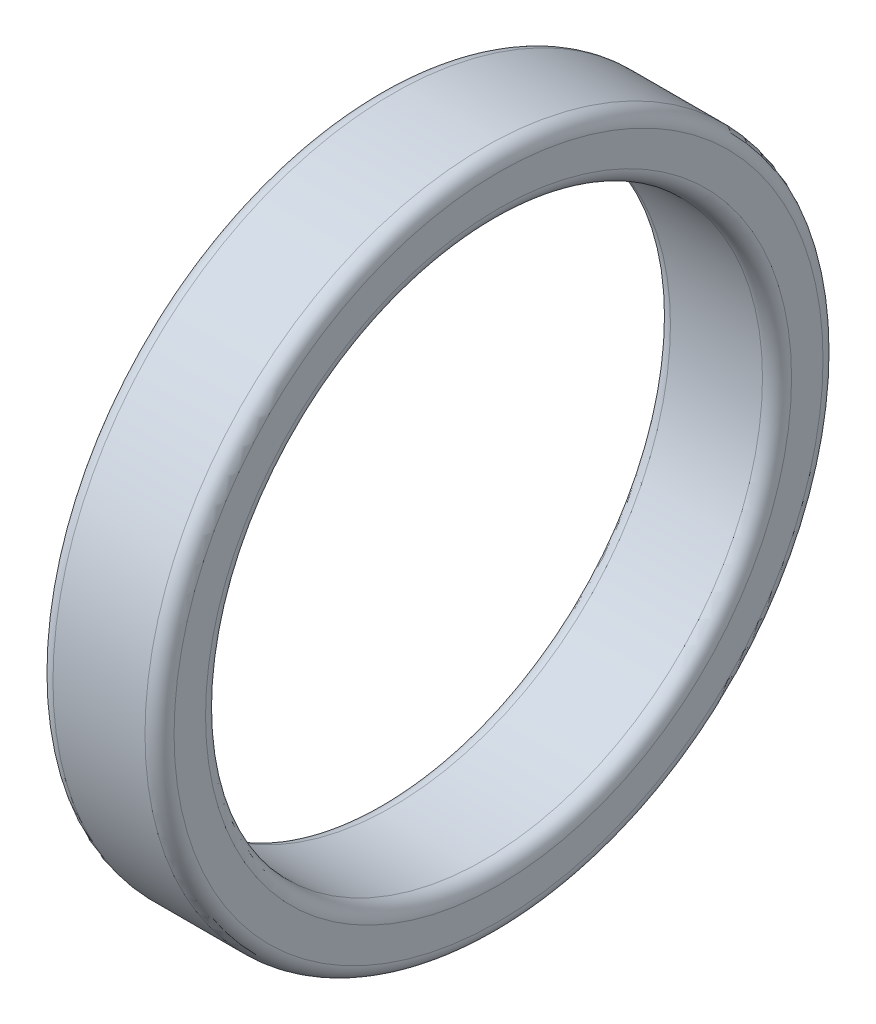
ISO-10303-21;
HEADER;
FILE_DESCRIPTION(('STEP AP214'),'2;1');
FILE_NAME('part.step','',(''),(''),'','','');
FILE_SCHEMA(('AUTOMOTIVE_DESIGN { 1 0 10303 214 1 1 1 1 }'));
ENDSEC;
DATA;
#1=APPLICATION_CONTEXT('core data for automotive mechanical design processes');
#2=APPLICATION_PROTOCOL_DEFINITION('international standard','automotive_design',2000,#1);
#3=PRODUCT_CONTEXT('',#1,'mechanical');
#4=PRODUCT('Part','Part','',(#3));
#5=PRODUCT_RELATED_PRODUCT_CATEGORY('part','',(#4));
#6=PRODUCT_DEFINITION_FORMATION('','',#4);
#7=PRODUCT_DEFINITION_CONTEXT('part definition',#1,'design');
#8=PRODUCT_DEFINITION('design','',#6,#7);
#9=PRODUCT_DEFINITION_SHAPE('','',#8);
#10=(LENGTH_UNIT() NAMED_UNIT(*) SI_UNIT(.MILLI.,.METRE.));
#11=(NAMED_UNIT(*) PLANE_ANGLE_UNIT() SI_UNIT($,.RADIAN.));
#12=(NAMED_UNIT(*) SI_UNIT($,.STERADIAN.) SOLID_ANGLE_UNIT());
#13=UNCERTAINTY_MEASURE_WITH_UNIT(LENGTH_MEASURE(1.E-05),#10,'distance_accuracy_value','');
#14=(GEOMETRIC_REPRESENTATION_CONTEXT(3) GLOBAL_UNCERTAINTY_ASSIGNED_CONTEXT((#13)) GLOBAL_UNIT_ASSIGNED_CONTEXT((#10,
#11,#12)) REPRESENTATION_CONTEXT('',''));
#15=CARTESIAN_POINT('',(0.,0.,0.));
#16=DIRECTION('',(0.,0.,1.));
#17=DIRECTION('',(1.,0.,0.));
#18=AXIS2_PLACEMENT_3D('',#15,#16,#17);
#19=CARTESIAN_POINT('',(-2.2,0.,0.));
#20=DIRECTION('',(-1.,0.,0.));
#21=DIRECTION('',(0.,0.,1.));
#22=AXIS2_PLACEMENT_3D('',#19,#20,#21);
#23=TOROIDAL_SURFACE('',#22,6.7,0.3);
#24=CARTESIAN_POINT('',(-2.5,0.,0.));
#25=DIRECTION('',(-1.,0.,0.));
#26=DIRECTION('',(0.,0.,1.));
#27=AXIS2_PLACEMENT_3D('',#24,#25,#26);
#28=CIRCLE('',#27,6.7);
#29=CARTESIAN_POINT('',(-2.5,0.,6.7));
#30=VERTEX_POINT('',#29);
#31=EDGE_CURVE('E52',#30,#30,#28,.T.);
#32=ORIENTED_EDGE('',*,*,#31,.F.);
#33=EDGE_LOOP('',(#32));
#34=FACE_BOUND('',#33,.T.);
#35=CARTESIAN_POINT('',(-2.2,0.,0.));
#36=DIRECTION('',(-1.,0.,0.));
#37=DIRECTION('',(0.,0.,1.));
#38=AXIS2_PLACEMENT_3D('',#35,#36,#37);
#39=CIRCLE('',#38,7.);
#40=CARTESIAN_POINT('',(-2.2,0.,7.));
#41=VERTEX_POINT('',#40);
#42=EDGE_CURVE('E10',#41,#41,#39,.T.);
#43=ORIENTED_EDGE('',*,*,#42,.T.);
#44=EDGE_LOOP('',(#43));
#45=FACE_BOUND('',#44,.T.);
#46=ADVANCED_FACE('F24',(#34,#45),#23,.T.);
#47=CARTESIAN_POINT('',(-7.5,0.,0.));
#48=DIRECTION('',(-1.,0.,0.));
#49=DIRECTION('',(0.,0.,1.));
#50=AXIS2_PLACEMENT_3D('',#47,#48,#49);
#51=CYLINDRICAL_SURFACE('',#50,7.);
#52=ORIENTED_EDGE('',*,*,#42,.F.);
#53=EDGE_LOOP('',(#52));
#54=FACE_BOUND('',#53,.T.);
#55=CARTESIAN_POINT('',(-0.300000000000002,0.,0.));
#56=DIRECTION('',(-1.,0.,0.));
#57=DIRECTION('',(0.,0.,1.));
#58=AXIS2_PLACEMENT_3D('',#55,#56,#57);
#59=CIRCLE('',#58,7.);
#60=CARTESIAN_POINT('',(-0.300000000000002,0.,7.));
#61=VERTEX_POINT('',#60);
#62=EDGE_CURVE('E30',#61,#61,#59,.T.);
#63=ORIENTED_EDGE('',*,*,#62,.T.);
#64=EDGE_LOOP('',(#63));
#65=FACE_BOUND('',#64,.T.);
#66=ADVANCED_FACE('F59',(#54,#65),#51,.T.);
#67=CARTESIAN_POINT('',(-0.300000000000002,0.,0.));
#68=DIRECTION('',(-1.,0.,0.));
#69=DIRECTION('',(0.,0.,1.));
#70=AXIS2_PLACEMENT_3D('',#67,#68,#69);
#71=TOROIDAL_SURFACE('',#70,6.7,0.3);
#72=ORIENTED_EDGE('',*,*,#62,.F.);
#73=EDGE_LOOP('',(#72));
#74=FACE_BOUND('',#73,.T.);
#75=CARTESIAN_POINT('',(0.,0.,0.));
#76=DIRECTION('',(-1.,0.,0.));
#77=DIRECTION('',(0.,0.,1.));
#78=AXIS2_PLACEMENT_3D('',#75,#76,#77);
#79=CIRCLE('',#78,6.7);
#80=CARTESIAN_POINT('',(0.,0.,6.7));
#81=VERTEX_POINT('',#80);
#82=EDGE_CURVE('E34',#81,#81,#79,.T.);
#83=ORIENTED_EDGE('',*,*,#82,.T.);
#84=EDGE_LOOP('',(#83));
#85=FACE_BOUND('',#84,.T.);
#86=ADVANCED_FACE('F63',(#74,#85),#71,.T.);
#87=CARTESIAN_POINT('',(0.,6.70000000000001,0.));
#88=DIRECTION('',(-1.,0.,0.));
#89=DIRECTION('',(0.,0.,1.));
#90=AXIS2_PLACEMENT_3D('',#87,#88,#89);
#91=PLANE('',#90);
#92=ORIENTED_EDGE('',*,*,#82,.F.);
#93=EDGE_LOOP('',(#92));
#94=FACE_BOUND('',#93,.T.);
#95=CARTESIAN_POINT('',(0.,0.,0.));
#96=DIRECTION('',(-1.,0.,0.));
#97=DIRECTION('',(0.,0.,1.));
#98=AXIS2_PLACEMENT_3D('',#95,#96,#97);
#99=CIRCLE('',#98,6.05);
#100=CARTESIAN_POINT('',(0.,0.,6.05));
#101=VERTEX_POINT('',#100);
#102=EDGE_CURVE('E38',#101,#101,#99,.T.);
#103=ORIENTED_EDGE('',*,*,#102,.T.);
#104=EDGE_LOOP('',(#103));
#105=FACE_BOUND('',#104,.T.);
#106=ADVANCED_FACE('F68',(#94,#105),#91,.F.);
#107=CARTESIAN_POINT('',(-0.300000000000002,0.,0.));
#108=DIRECTION('',(-1.,0.,0.));
#109=DIRECTION('',(0.,0.,1.));
#110=AXIS2_PLACEMENT_3D('',#107,#108,#109);
#111=TOROIDAL_SURFACE('',#110,6.05,0.3);
#112=ORIENTED_EDGE('',*,*,#102,.F.);
#113=EDGE_LOOP('',(#112));
#114=FACE_BOUND('',#113,.T.);
#115=CARTESIAN_POINT('',(-0.300000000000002,0.,0.));
#116=DIRECTION('',(-1.,0.,0.));
#117=DIRECTION('',(0.,0.,1.));
#118=AXIS2_PLACEMENT_3D('',#115,#116,#117);
#119=CIRCLE('',#118,5.75);
#120=CARTESIAN_POINT('',(-0.300000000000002,0.,5.75));
#121=VERTEX_POINT('',#120);
#122=EDGE_CURVE('E43',#121,#121,#119,.T.);
#123=ORIENTED_EDGE('',*,*,#122,.T.);
#124=EDGE_LOOP('',(#123));
#125=FACE_BOUND('',#124,.T.);
#126=ADVANCED_FACE('F74',(#114,#125),#111,.T.);
#127=CARTESIAN_POINT('',(-7.5,0.,0.));
#128=DIRECTION('',(-1.,0.,0.));
#129=DIRECTION('',(0.,0.,1.));
#130=AXIS2_PLACEMENT_3D('',#127,#128,#129);
#131=CYLINDRICAL_SURFACE('',#130,5.75);
#132=ORIENTED_EDGE('',*,*,#122,.F.);
#133=EDGE_LOOP('',(#132));
#134=FACE_BOUND('',#133,.T.);
#135=CARTESIAN_POINT('',(-2.2,0.,0.));
#136=DIRECTION('',(-1.,0.,0.));
#137=DIRECTION('',(0.,0.,1.));
#138=AXIS2_PLACEMENT_3D('',#135,#136,#137);
#139=CIRCLE('',#138,5.75);
#140=CARTESIAN_POINT('',(-2.2,0.,5.75));
#141=VERTEX_POINT('',#140);
#142=EDGE_CURVE('E46',#141,#141,#139,.T.);
#143=ORIENTED_EDGE('',*,*,#142,.T.);
#144=EDGE_LOOP('',(#143));
#145=FACE_BOUND('',#144,.T.);
#146=ADVANCED_FACE('F78',(#134,#145),#131,.F.);
#147=CARTESIAN_POINT('',(-2.2,0.,0.));
#148=DIRECTION('',(-1.,0.,0.));
#149=DIRECTION('',(0.,0.,1.));
#150=AXIS2_PLACEMENT_3D('',#147,#148,#149);
#151=TOROIDAL_SURFACE('',#150,6.05,0.3);
#152=ORIENTED_EDGE('',*,*,#142,.F.);
#153=EDGE_LOOP('',(#152));
#154=FACE_BOUND('',#153,.T.);
#155=CARTESIAN_POINT('',(-2.5,0.,0.));
#156=DIRECTION('',(-1.,0.,0.));
#157=DIRECTION('',(0.,0.,1.));
#158=AXIS2_PLACEMENT_3D('',#155,#156,#157);
#159=CIRCLE('',#158,6.05);
#160=CARTESIAN_POINT('',(-2.5,0.,6.05));
#161=VERTEX_POINT('',#160);
#162=EDGE_CURVE('E49',#161,#161,#159,.T.);
#163=ORIENTED_EDGE('',*,*,#162,.T.);
#164=EDGE_LOOP('',(#163));
#165=FACE_BOUND('',#164,.T.);
#166=ADVANCED_FACE('F82',(#154,#165),#151,.T.);
#167=CARTESIAN_POINT('',(-2.5,6.7,0.));
#168=DIRECTION('',(1.,0.,0.));
#169=DIRECTION('',(0.,0.,-1.));
#170=AXIS2_PLACEMENT_3D('',#167,#168,#169);
#171=PLANE('',#170);
#172=ORIENTED_EDGE('',*,*,#162,.F.);
#173=EDGE_LOOP('',(#172));
#174=FACE_BOUND('',#173,.T.);
#175=ORIENTED_EDGE('',*,*,#31,.T.);
#176=EDGE_LOOP('',(#175));
#177=FACE_BOUND('',#176,.T.);
#178=ADVANCED_FACE('F56',(#174,#177),#171,.F.);
#179=CLOSED_SHELL('',(#46,#66,#86,#106,#126,#146,#166,#178));
#180=MANIFOLD_SOLID_BREP('B2',#179);
#181=ADVANCED_BREP_SHAPE_REPRESENTATION('',(#18,#180),#14);
#182=SHAPE_DEFINITION_REPRESENTATION(#9,#181);
ENDSEC;
END-ISO-10303-21;
